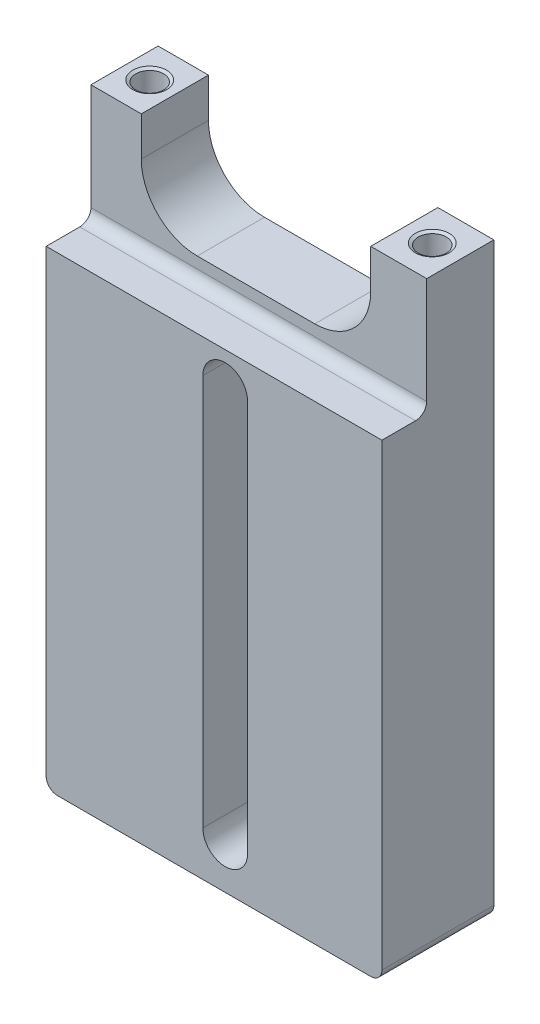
ISO-10303-21;
HEADER;
FILE_DESCRIPTION(('STEP AP214'),'2;1');
FILE_NAME('part.step','',(''),(''),'','','');
FILE_SCHEMA(('AUTOMOTIVE_DESIGN { 1 0 10303 214 1 1 1 1 }'));
ENDSEC;
DATA;
#1=APPLICATION_CONTEXT('core data for automotive mechanical design processes');
#2=APPLICATION_PROTOCOL_DEFINITION('international standard','automotive_design',2000,#1);
#3=PRODUCT_CONTEXT('',#1,'mechanical');
#4=PRODUCT('Part','Part','',(#3));
#5=PRODUCT_RELATED_PRODUCT_CATEGORY('part','',(#4));
#6=PRODUCT_DEFINITION_FORMATION('','',#4);
#7=PRODUCT_DEFINITION_CONTEXT('part definition',#1,'design');
#8=PRODUCT_DEFINITION('design','',#6,#7);
#9=PRODUCT_DEFINITION_SHAPE('','',#8);
#10=(LENGTH_UNIT() NAMED_UNIT(*) SI_UNIT(.MILLI.,.METRE.));
#11=(NAMED_UNIT(*) PLANE_ANGLE_UNIT() SI_UNIT($,.RADIAN.));
#12=(NAMED_UNIT(*) SI_UNIT($,.STERADIAN.) SOLID_ANGLE_UNIT());
#13=UNCERTAINTY_MEASURE_WITH_UNIT(LENGTH_MEASURE(1.E-05),#10,'distance_accuracy_value','');
#14=(GEOMETRIC_REPRESENTATION_CONTEXT(3) GLOBAL_UNCERTAINTY_ASSIGNED_CONTEXT((#13)) GLOBAL_UNIT_ASSIGNED_CONTEXT((#10,
#11,#12)) REPRESENTATION_CONTEXT('',''));
#15=CARTESIAN_POINT('',(0.,0.,0.));
#16=DIRECTION('',(0.,0.,1.));
#17=DIRECTION('',(1.,0.,0.));
#18=AXIS2_PLACEMENT_3D('',#15,#16,#17);
#19=CARTESIAN_POINT('',(20.,105.,20.));
#20=DIRECTION('',(0.,-1.,0.));
#21=DIRECTION('',(1.,0.,0.));
#22=AXIS2_PLACEMENT_3D('',#19,#20,#21);
#23=PLANE('',#22);
#24=CARTESIAN_POINT('',(24.9999999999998,105.,6.));
#25=DIRECTION('',(0.,1.,0.));
#26=DIRECTION('',(0.,0.,1.));
#27=AXIS2_PLACEMENT_3D('',#24,#25,#26);
#28=CIRCLE('',#27,3.025);
#29=CARTESIAN_POINT('',(24.9999999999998,105.,9.025));
#30=VERTEX_POINT('',#29);
#31=EDGE_CURVE('E180',#30,#30,#28,.T.);
#32=ORIENTED_EDGE('',*,*,#31,.F.);
#33=EDGE_LOOP('',(#32));
#34=FACE_BOUND('',#33,.T.);
#35=DIRECTION('',(0.,0.,-1.));
#36=VECTOR('',#35,1.);
#37=CARTESIAN_POINT('',(20.,105.,20.));
#38=LINE('',#37,#36);
#39=CARTESIAN_POINT('',(20.,105.,12.));
#40=VERTEX_POINT('',#39);
#41=CARTESIAN_POINT('',(20.,105.,0.));
#42=VERTEX_POINT('',#41);
#43=EDGE_CURVE('E311',#40,#42,#38,.T.);
#44=ORIENTED_EDGE('',*,*,#43,.F.);
#45=DIRECTION('',(1.,0.,0.));
#46=VECTOR('',#45,1.);
#47=CARTESIAN_POINT('',(20.,105.,12.));
#48=LINE('',#47,#46);
#49=CARTESIAN_POINT('',(30.,105.,12.));
#50=VERTEX_POINT('',#49);
#51=EDGE_CURVE('E259',#40,#50,#48,.T.);
#52=ORIENTED_EDGE('',*,*,#51,.T.);
#53=DIRECTION('',(0.,0.,-1.));
#54=VECTOR('',#53,1.);
#55=CARTESIAN_POINT('',(30.,105.,20.));
#56=LINE('',#55,#54);
#57=CARTESIAN_POINT('',(30.,105.,0.));
#58=VERTEX_POINT('',#57);
#59=EDGE_CURVE('E270',#50,#58,#56,.T.);
#60=ORIENTED_EDGE('',*,*,#59,.T.);
#61=DIRECTION('',(-1.,0.,0.));
#62=VECTOR('',#61,1.);
#63=CARTESIAN_POINT('',(20.,105.,0.));
#64=LINE('',#63,#62);
#65=EDGE_CURVE('E262',#58,#42,#64,.T.);
#66=ORIENTED_EDGE('',*,*,#65,.T.);
#67=EDGE_LOOP('',(#44,#52,#60,#66));
#68=FACE_BOUND('',#67,.T.);
#69=ADVANCED_FACE('F33',(#34,#68),#23,.F.);
#70=CARTESIAN_POINT('',(20.,98.,20.));
#71=DIRECTION('',(1.,0.,0.));
#72=DIRECTION('',(0.,0.,-1.));
#73=AXIS2_PLACEMENT_3D('',#70,#71,#72);
#74=PLANE('',#73);
#75=DIRECTION('',(0.,0.,-1.));
#76=VECTOR('',#75,1.);
#77=CARTESIAN_POINT('',(20.,98.,20.));
#78=LINE('',#77,#76);
#79=CARTESIAN_POINT('',(20.,98.,12.));
#80=VERTEX_POINT('',#79);
#81=CARTESIAN_POINT('',(20.,98.,0.));
#82=VERTEX_POINT('',#81);
#83=EDGE_CURVE('E309',#80,#82,#78,.T.);
#84=ORIENTED_EDGE('',*,*,#83,.F.);
#85=DIRECTION('',(0.,1.,0.));
#86=VECTOR('',#85,1.);
#87=CARTESIAN_POINT('',(20.,98.,12.));
#88=LINE('',#87,#86);
#89=EDGE_CURVE('E256',#80,#40,#88,.T.);
#90=ORIENTED_EDGE('',*,*,#89,.T.);
#91=ORIENTED_EDGE('',*,*,#43,.T.);
#92=DIRECTION('',(0.,-1.,0.));
#93=VECTOR('',#92,1.);
#94=CARTESIAN_POINT('',(20.,98.,0.));
#95=LINE('',#94,#93);
#96=EDGE_CURVE('E273',#42,#82,#95,.T.);
#97=ORIENTED_EDGE('',*,*,#96,.T.);
#98=EDGE_LOOP('',(#84,#90,#91,#97));
#99=FACE_BOUND('',#98,.T.);
#100=ADVANCED_FACE('F384',(#99),#74,.F.);
#101=CARTESIAN_POINT('',(10.,98.,20.));
#102=DIRECTION('',(0.,0.,-1.));
#103=DIRECTION('',(-1.,0.,0.));
#104=AXIS2_PLACEMENT_3D('',#101,#102,#103);
#105=CYLINDRICAL_SURFACE('',#104,10.);
#106=DIRECTION('',(0.,0.,-1.));
#107=VECTOR('',#106,1.);
#108=CARTESIAN_POINT('',(9.99999999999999,88.,20.));
#109=LINE('',#108,#107);
#110=CARTESIAN_POINT('',(9.99999999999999,88.,12.));
#111=VERTEX_POINT('',#110);
#112=CARTESIAN_POINT('',(9.99999999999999,88.,0.));
#113=VERTEX_POINT('',#112);
#114=EDGE_CURVE('E307',#111,#113,#109,.T.);
#115=ORIENTED_EDGE('',*,*,#114,.F.);
#116=CARTESIAN_POINT('',(10.,98.,12.));
#117=DIRECTION('',(0.,0.,-1.));
#118=DIRECTION('',(-1.,0.,0.));
#119=AXIS2_PLACEMENT_3D('',#116,#117,#118);
#120=CIRCLE('',#119,10.);
#121=EDGE_CURVE('E253',#111,#80,#120,.F.);
#122=ORIENTED_EDGE('',*,*,#121,.T.);
#123=ORIENTED_EDGE('',*,*,#83,.T.);
#124=CARTESIAN_POINT('',(10.,98.,0.));
#125=DIRECTION('',(0.,0.,-1.));
#126=DIRECTION('',(1.,0.,0.));
#127=AXIS2_PLACEMENT_3D('',#124,#125,#126);
#128=CIRCLE('',#127,10.);
#129=EDGE_CURVE('E276',#82,#113,#128,.T.);
#130=ORIENTED_EDGE('',*,*,#129,.T.);
#131=EDGE_LOOP('',(#115,#122,#123,#130));
#132=FACE_BOUND('',#131,.T.);
#133=ADVANCED_FACE('F387',(#132),#105,.F.);
#134=CARTESIAN_POINT('',(-11.,88.,20.));
#135=DIRECTION('',(0.,-1.,0.));
#136=DIRECTION('',(0.,0.,-1.));
#137=AXIS2_PLACEMENT_3D('',#134,#135,#136);
#138=PLANE('',#137);
#139=DIRECTION('',(0.,0.,-1.));
#140=VECTOR('',#139,1.);
#141=CARTESIAN_POINT('',(-11.,88.,20.));
#142=LINE('',#141,#140);
#143=CARTESIAN_POINT('',(-11.,88.,12.));
#144=VERTEX_POINT('',#143);
#145=CARTESIAN_POINT('',(-11.,88.,0.));
#146=VERTEX_POINT('',#145);
#147=EDGE_CURVE('E305',#144,#146,#142,.T.);
#148=ORIENTED_EDGE('',*,*,#147,.F.);
#149=DIRECTION('',(1.,0.,0.));
#150=VECTOR('',#149,1.);
#151=CARTESIAN_POINT('',(-11.,88.,12.));
#152=LINE('',#151,#150);
#153=EDGE_CURVE('E250',#144,#111,#152,.T.);
#154=ORIENTED_EDGE('',*,*,#153,.T.);
#155=ORIENTED_EDGE('',*,*,#114,.T.);
#156=DIRECTION('',(-1.,0.,0.));
#157=VECTOR('',#156,1.);
#158=CARTESIAN_POINT('',(-11.,88.,0.));
#159=LINE('',#158,#157);
#160=EDGE_CURVE('E279',#113,#146,#159,.T.);
#161=ORIENTED_EDGE('',*,*,#160,.T.);
#162=EDGE_LOOP('',(#148,#154,#155,#161));
#163=FACE_BOUND('',#162,.T.);
#164=ADVANCED_FACE('F391',(#163),#138,.F.);
#165=CARTESIAN_POINT('',(-11.,98.,20.));
#166=DIRECTION('',(0.,0.,-1.));
#167=DIRECTION('',(-1.,0.,0.));
#168=AXIS2_PLACEMENT_3D('',#165,#166,#167);
#169=CYLINDRICAL_SURFACE('',#168,10.);
#170=DIRECTION('',(0.,0.,-1.));
#171=VECTOR('',#170,1.);
#172=CARTESIAN_POINT('',(-21.,98.,20.));
#173=LINE('',#172,#171);
#174=CARTESIAN_POINT('',(-21.,98.,12.));
#175=VERTEX_POINT('',#174);
#176=CARTESIAN_POINT('',(-21.,98.,0.));
#177=VERTEX_POINT('',#176);
#178=EDGE_CURVE('E303',#175,#177,#173,.T.);
#179=ORIENTED_EDGE('',*,*,#178,.F.);
#180=CARTESIAN_POINT('',(-11.,98.,12.));
#181=DIRECTION('',(0.,0.,-1.));
#182=DIRECTION('',(-1.,0.,0.));
#183=AXIS2_PLACEMENT_3D('',#180,#181,#182);
#184=CIRCLE('',#183,10.);
#185=EDGE_CURVE('E247',#175,#144,#184,.F.);
#186=ORIENTED_EDGE('',*,*,#185,.T.);
#187=ORIENTED_EDGE('',*,*,#147,.T.);
#188=CARTESIAN_POINT('',(-11.,98.,0.));
#189=DIRECTION('',(0.,0.,-1.));
#190=DIRECTION('',(1.,0.,0.));
#191=AXIS2_PLACEMENT_3D('',#188,#189,#190);
#192=CIRCLE('',#191,10.);
#193=EDGE_CURVE('E282',#146,#177,#192,.T.);
#194=ORIENTED_EDGE('',*,*,#193,.T.);
#195=EDGE_LOOP('',(#179,#186,#187,#194));
#196=FACE_BOUND('',#195,.T.);
#197=ADVANCED_FACE('F393',(#196),#169,.F.);
#198=CARTESIAN_POINT('',(-21.,105.,20.));
#199=DIRECTION('',(-1.,0.,0.));
#200=DIRECTION('',(0.,0.,1.));
#201=AXIS2_PLACEMENT_3D('',#198,#199,#200);
#202=PLANE('',#201);
#203=DIRECTION('',(0.,0.,-1.));
#204=VECTOR('',#203,1.);
#205=CARTESIAN_POINT('',(-21.,105.,20.));
#206=LINE('',#205,#204);
#207=CARTESIAN_POINT('',(-21.,105.,12.));
#208=VERTEX_POINT('',#207);
#209=CARTESIAN_POINT('',(-21.,105.,0.));
#210=VERTEX_POINT('',#209);
#211=EDGE_CURVE('E301',#208,#210,#206,.T.);
#212=ORIENTED_EDGE('',*,*,#211,.F.);
#213=DIRECTION('',(0.,-1.,0.));
#214=VECTOR('',#213,1.);
#215=CARTESIAN_POINT('',(-21.,105.,12.));
#216=LINE('',#215,#214);
#217=EDGE_CURVE('E244',#208,#175,#216,.T.);
#218=ORIENTED_EDGE('',*,*,#217,.T.);
#219=ORIENTED_EDGE('',*,*,#178,.T.);
#220=DIRECTION('',(0.,1.,0.));
#221=VECTOR('',#220,1.);
#222=CARTESIAN_POINT('',(-21.,105.,0.));
#223=LINE('',#222,#221);
#224=EDGE_CURVE('E285',#177,#210,#223,.T.);
#225=ORIENTED_EDGE('',*,*,#224,.T.);
#226=EDGE_LOOP('',(#212,#218,#219,#225));
#227=FACE_BOUND('',#226,.T.);
#228=ADVANCED_FACE('F356',(#227),#202,.F.);
#229=CARTESIAN_POINT('',(-30.,105.,20.));
#230=DIRECTION('',(0.,-1.,0.));
#231=DIRECTION('',(1.,0.,0.));
#232=AXIS2_PLACEMENT_3D('',#229,#230,#231);
#233=PLANE('',#232);
#234=CARTESIAN_POINT('',(-25.5000000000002,105.,6.00000000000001));
#235=DIRECTION('',(0.,1.,0.));
#236=DIRECTION('',(0.,0.,1.));
#237=AXIS2_PLACEMENT_3D('',#234,#235,#236);
#238=CIRCLE('',#237,3.025);
#239=CARTESIAN_POINT('',(-25.5000000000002,105.,9.02500000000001));
#240=VERTEX_POINT('',#239);
#241=EDGE_CURVE('E187',#240,#240,#238,.T.);
#242=ORIENTED_EDGE('',*,*,#241,.F.);
#243=EDGE_LOOP('',(#242));
#244=FACE_BOUND('',#243,.T.);
#245=DIRECTION('',(0.,0.,-1.));
#246=VECTOR('',#245,1.);
#247=CARTESIAN_POINT('',(-30.,105.,20.));
#248=LINE('',#247,#246);
#249=CARTESIAN_POINT('',(-30.,105.,12.));
#250=VERTEX_POINT('',#249);
#251=CARTESIAN_POINT('',(-30.,105.,0.));
#252=VERTEX_POINT('',#251);
#253=EDGE_CURVE('E299',#250,#252,#248,.T.);
#254=ORIENTED_EDGE('',*,*,#253,.F.);
#255=DIRECTION('',(1.,0.,0.));
#256=VECTOR('',#255,1.);
#257=CARTESIAN_POINT('',(-30.,105.,12.));
#258=LINE('',#257,#256);
#259=EDGE_CURVE('E240',#250,#208,#258,.T.);
#260=ORIENTED_EDGE('',*,*,#259,.T.);
#261=ORIENTED_EDGE('',*,*,#211,.T.);
#262=DIRECTION('',(-1.,0.,0.));
#263=VECTOR('',#262,1.);
#264=CARTESIAN_POINT('',(-30.,105.,0.));
#265=LINE('',#264,#263);
#266=EDGE_CURVE('E288',#210,#252,#265,.T.);
#267=ORIENTED_EDGE('',*,*,#266,.T.);
#268=EDGE_LOOP('',(#254,#260,#261,#267));
#269=FACE_BOUND('',#268,.T.);
#270=ADVANCED_FACE('F354',(#244,#269),#233,.F.);
#271=CARTESIAN_POINT('',(-30.,0.,20.));
#272=DIRECTION('',(1.,0.,0.));
#273=DIRECTION('',(0.,1.,0.));
#274=AXIS2_PLACEMENT_3D('',#271,#272,#273);
#275=PLANE('',#274);
#276=DIRECTION('',(0.,-1.,0.));
#277=VECTOR('',#276,1.);
#278=CARTESIAN_POINT('',(-30.,0.,0.));
#279=LINE('',#278,#277);
#280=CARTESIAN_POINT('',(-30.,2.,0.));
#281=VERTEX_POINT('',#280);
#282=EDGE_CURVE('E291',#252,#281,#279,.T.);
#283=ORIENTED_EDGE('',*,*,#282,.T.);
#284=DIRECTION('',(0.,0.,-1.));
#285=VECTOR('',#284,1.);
#286=CARTESIAN_POINT('',(-30.,2.,20.));
#287=LINE('',#286,#285);
#288=CARTESIAN_POINT('',(-30.,2.,20.));
#289=VERTEX_POINT('',#288);
#290=EDGE_CURVE('E56',#281,#289,#287,.F.);
#291=ORIENTED_EDGE('',*,*,#290,.T.);
#292=DIRECTION('',(0.,-1.,0.));
#293=VECTOR('',#292,1.);
#294=CARTESIAN_POINT('',(-30.,0.,20.));
#295=LINE('',#294,#293);
#296=CARTESIAN_POINT('',(-30.,84.,20.));
#297=VERTEX_POINT('',#296);
#298=EDGE_CURVE('E263',#297,#289,#295,.T.);
#299=ORIENTED_EDGE('',*,*,#298,.F.);
#300=DIRECTION('',(0.,0.,1.));
#301=VECTOR('',#300,1.);
#302=CARTESIAN_POINT('',(-30.,84.,12.));
#303=LINE('',#302,#301);
#304=CARTESIAN_POINT('',(-30.,84.,14.));
#305=VERTEX_POINT('',#304);
#306=EDGE_CURVE('E234',#305,#297,#303,.T.);
#307=ORIENTED_EDGE('',*,*,#306,.F.);
#308=CARTESIAN_POINT('',(-30.,86.,14.));
#309=DIRECTION('',(1.,0.,0.));
#310=DIRECTION('',(0.,1.,0.));
#311=AXIS2_PLACEMENT_3D('',#308,#309,#310);
#312=CIRCLE('',#311,2.);
#313=CARTESIAN_POINT('',(-30.,86.,12.));
#314=VERTEX_POINT('',#313);
#315=EDGE_CURVE('E11',#305,#314,#312,.T.);
#316=ORIENTED_EDGE('',*,*,#315,.T.);
#317=DIRECTION('',(0.,-1.,0.));
#318=VECTOR('',#317,1.);
#319=CARTESIAN_POINT('',(-30.,139.670454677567,12.));
#320=LINE('',#319,#318);
#321=EDGE_CURVE('E229',#250,#314,#320,.T.);
#322=ORIENTED_EDGE('',*,*,#321,.F.);
#323=ORIENTED_EDGE('',*,*,#253,.T.);
#324=EDGE_LOOP('',(#283,#291,#299,#307,#316,#322,#323));
#325=FACE_BOUND('',#324,.T.);
#326=ADVANCED_FACE('F348',(#325),#275,.F.);
#327=CARTESIAN_POINT('',(30.,0.,20.));
#328=DIRECTION('',(0.,1.,0.));
#329=DIRECTION('',(0.,0.,1.));
#330=AXIS2_PLACEMENT_3D('',#327,#328,#329);
#331=PLANE('',#330);
#332=DIRECTION('',(1.,0.,0.));
#333=VECTOR('',#332,1.);
#334=CARTESIAN_POINT('',(30.,0.,20.));
#335=LINE('',#334,#333);
#336=CARTESIAN_POINT('',(-28.,0.,20.));
#337=VERTEX_POINT('',#336);
#338=CARTESIAN_POINT('',(28.,0.,20.));
#339=VERTEX_POINT('',#338);
#340=EDGE_CURVE('E265',#337,#339,#335,.T.);
#341=ORIENTED_EDGE('',*,*,#340,.F.);
#342=DIRECTION('',(0.,0.,-1.));
#343=VECTOR('',#342,1.);
#344=CARTESIAN_POINT('',(-28.,0.,20.));
#345=LINE('',#344,#343);
#346=CARTESIAN_POINT('',(-28.,0.,0.));
#347=VERTEX_POINT('',#346);
#348=EDGE_CURVE('E320',#337,#347,#345,.T.);
#349=ORIENTED_EDGE('',*,*,#348,.T.);
#350=DIRECTION('',(1.,0.,0.));
#351=VECTOR('',#350,1.);
#352=CARTESIAN_POINT('',(30.,0.,0.));
#353=LINE('',#352,#351);
#354=CARTESIAN_POINT('',(28.,0.,0.));
#355=VERTEX_POINT('',#354);
#356=EDGE_CURVE('E293',#347,#355,#353,.T.);
#357=ORIENTED_EDGE('',*,*,#356,.T.);
#358=DIRECTION('',(0.,0.,-1.));
#359=VECTOR('',#358,1.);
#360=CARTESIAN_POINT('',(28.,0.,20.));
#361=LINE('',#360,#359);
#362=EDGE_CURVE('E318',#355,#339,#361,.F.);
#363=ORIENTED_EDGE('',*,*,#362,.T.);
#364=EDGE_LOOP('',(#341,#349,#357,#363));
#365=FACE_BOUND('',#364,.T.);
#366=ADVANCED_FACE('F372',(#365),#331,.F.);
#367=CARTESIAN_POINT('',(30.,105.,20.));
#368=DIRECTION('',(-1.,0.,0.));
#369=DIRECTION('',(0.,-1.,0.));
#370=AXIS2_PLACEMENT_3D('',#367,#368,#369);
#371=PLANE('',#370);
#372=DIRECTION('',(0.,1.,0.));
#373=VECTOR('',#372,1.);
#374=CARTESIAN_POINT('',(30.,105.,20.));
#375=LINE('',#374,#373);
#376=CARTESIAN_POINT('',(30.,2.,20.));
#377=VERTEX_POINT('',#376);
#378=CARTESIAN_POINT('',(30.,84.,20.));
#379=VERTEX_POINT('',#378);
#380=EDGE_CURVE('E268',#377,#379,#375,.T.);
#381=ORIENTED_EDGE('',*,*,#380,.F.);
#382=DIRECTION('',(0.,0.,-1.));
#383=VECTOR('',#382,1.);
#384=CARTESIAN_POINT('',(30.,2.,20.));
#385=LINE('',#384,#383);
#386=CARTESIAN_POINT('',(30.,2.,0.));
#387=VERTEX_POINT('',#386);
#388=EDGE_CURVE('E331',#377,#387,#385,.T.);
#389=ORIENTED_EDGE('',*,*,#388,.T.);
#390=DIRECTION('',(0.,1.,0.));
#391=VECTOR('',#390,1.);
#392=CARTESIAN_POINT('',(30.,105.,0.));
#393=LINE('',#392,#391);
#394=EDGE_CURVE('E266',#387,#58,#393,.T.);
#395=ORIENTED_EDGE('',*,*,#394,.T.);
#396=ORIENTED_EDGE('',*,*,#59,.F.);
#397=DIRECTION('',(0.,1.,0.));
#398=VECTOR('',#397,1.);
#399=CARTESIAN_POINT('',(30.,139.670454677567,12.));
#400=LINE('',#399,#398);
#401=CARTESIAN_POINT('',(30.,86.,12.));
#402=VERTEX_POINT('',#401);
#403=EDGE_CURVE('E232',#402,#50,#400,.T.);
#404=ORIENTED_EDGE('',*,*,#403,.F.);
#405=CARTESIAN_POINT('',(30.,86.,14.));
#406=DIRECTION('',(-1.,0.,0.));
#407=DIRECTION('',(0.,-1.,0.));
#408=AXIS2_PLACEMENT_3D('',#405,#406,#407);
#409=CIRCLE('',#408,2.);
#410=CARTESIAN_POINT('',(30.,84.,14.));
#411=VERTEX_POINT('',#410);
#412=EDGE_CURVE('E41',#402,#411,#409,.T.);
#413=ORIENTED_EDGE('',*,*,#412,.T.);
#414=DIRECTION('',(0.,0.,1.));
#415=VECTOR('',#414,1.);
#416=CARTESIAN_POINT('',(30.,84.,12.));
#417=LINE('',#416,#415);
#418=EDGE_CURVE('E237',#411,#379,#417,.T.);
#419=ORIENTED_EDGE('',*,*,#418,.T.);
#420=EDGE_LOOP('',(#381,#389,#395,#396,#404,#413,#419));
#421=FACE_BOUND('',#420,.T.);
#422=ADVANCED_FACE('F336',(#421),#371,.F.);
#423=CARTESIAN_POINT('',(-11.,98.,20.));
#424=DIRECTION('',(0.,0.,1.));
#425=DIRECTION('',(1.,0.,0.));
#426=AXIS2_PLACEMENT_3D('',#423,#424,#425);
#427=PLANE('',#426);
#428=CARTESIAN_POINT('',(2.00000000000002,78.,20.));
#429=DIRECTION('',(0.,0.,1.));
#430=DIRECTION('',(1.,0.,0.));
#431=AXIS2_PLACEMENT_3D('',#428,#429,#430);
#432=CIRCLE('',#431,4.);
#433=CARTESIAN_POINT('',(-1.99999999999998,78.,20.));
#434=VERTEX_POINT('',#433);
#435=CARTESIAN_POINT('',(6.00000000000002,78.,20.));
#436=VERTEX_POINT('',#435);
#437=EDGE_CURVE('E202',#434,#436,#432,.F.);
#438=ORIENTED_EDGE('',*,*,#437,.T.);
#439=DIRECTION('',(0.,-1.,0.));
#440=VECTOR('',#439,1.);
#441=CARTESIAN_POINT('',(6.00000000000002,78.,20.));
#442=LINE('',#441,#440);
#443=CARTESIAN_POINT('',(6.00000000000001,7.99999999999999,20.));
#444=VERTEX_POINT('',#443);
#445=EDGE_CURVE('E219',#436,#444,#442,.T.);
#446=ORIENTED_EDGE('',*,*,#445,.T.);
#447=CARTESIAN_POINT('',(2.,8.,20.));
#448=DIRECTION('',(0.,0.,1.));
#449=DIRECTION('',(1.,0.,0.));
#450=AXIS2_PLACEMENT_3D('',#447,#448,#449);
#451=CIRCLE('',#450,4.);
#452=CARTESIAN_POINT('',(-2.,8.,20.));
#453=VERTEX_POINT('',#452);
#454=EDGE_CURVE('E196',#444,#453,#451,.F.);
#455=ORIENTED_EDGE('',*,*,#454,.T.);
#456=DIRECTION('',(0.,1.,0.));
#457=VECTOR('',#456,1.);
#458=CARTESIAN_POINT('',(-1.99999999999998,78.,20.));
#459=LINE('',#458,#457);
#460=EDGE_CURVE('E199',#453,#434,#459,.T.);
#461=ORIENTED_EDGE('',*,*,#460,.T.);
#462=EDGE_LOOP('',(#438,#446,#455,#461));
#463=FACE_BOUND('',#462,.T.);
#464=ORIENTED_EDGE('',*,*,#298,.T.);
#465=CARTESIAN_POINT('',(-28.,2.,20.));
#466=DIRECTION('',(0.,0.,1.));
#467=DIRECTION('',(1.,0.,0.));
#468=AXIS2_PLACEMENT_3D('',#465,#466,#467);
#469=CIRCLE('',#468,2.);
#470=EDGE_CURVE('E329',#289,#337,#469,.T.);
#471=ORIENTED_EDGE('',*,*,#470,.T.);
#472=ORIENTED_EDGE('',*,*,#340,.T.);
#473=CARTESIAN_POINT('',(28.,2.,20.));
#474=DIRECTION('',(0.,0.,1.));
#475=DIRECTION('',(1.,0.,0.));
#476=AXIS2_PLACEMENT_3D('',#473,#474,#475);
#477=CIRCLE('',#476,2.);
#478=EDGE_CURVE('E48',#339,#377,#477,.T.);
#479=ORIENTED_EDGE('',*,*,#478,.T.);
#480=ORIENTED_EDGE('',*,*,#380,.T.);
#481=DIRECTION('',(1.,0.,0.));
#482=VECTOR('',#481,1.);
#483=CARTESIAN_POINT('',(-30.,84.,20.));
#484=LINE('',#483,#482);
#485=EDGE_CURVE('E228',#297,#379,#484,.T.);
#486=ORIENTED_EDGE('',*,*,#485,.F.);
#487=EDGE_LOOP('',(#464,#471,#472,#479,#480,#486));
#488=FACE_BOUND('',#487,.T.);
#489=ADVANCED_FACE('F370',(#463,#488),#427,.T.);
#490=CARTESIAN_POINT('',(-11.,98.,0.));
#491=DIRECTION('',(0.,0.,1.));
#492=DIRECTION('',(1.,0.,0.));
#493=AXIS2_PLACEMENT_3D('',#490,#491,#492);
#494=PLANE('',#493);
#495=DIRECTION('',(0.,-1.,0.));
#496=VECTOR('',#495,1.);
#497=CARTESIAN_POINT('',(6.00000000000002,78.,0.));
#498=LINE('',#497,#496);
#499=CARTESIAN_POINT('',(6.00000000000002,78.,0.));
#500=VERTEX_POINT('',#499);
#501=CARTESIAN_POINT('',(6.00000000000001,8.,0.));
#502=VERTEX_POINT('',#501);
#503=EDGE_CURVE('E207',#500,#502,#498,.T.);
#504=ORIENTED_EDGE('',*,*,#503,.F.);
#505=CARTESIAN_POINT('',(2.00000000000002,78.,0.));
#506=DIRECTION('',(0.,0.,-1.));
#507=DIRECTION('',(1.,0.,0.));
#508=AXIS2_PLACEMENT_3D('',#505,#506,#507);
#509=CIRCLE('',#508,4.);
#510=CARTESIAN_POINT('',(-1.99999999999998,78.,0.));
#511=VERTEX_POINT('',#510);
#512=EDGE_CURVE('E205',#511,#500,#509,.T.);
#513=ORIENTED_EDGE('',*,*,#512,.F.);
#514=DIRECTION('',(0.,1.,0.));
#515=VECTOR('',#514,1.);
#516=CARTESIAN_POINT('',(-1.99999999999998,78.,0.));
#517=LINE('',#516,#515);
#518=CARTESIAN_POINT('',(-2.,8.,0.));
#519=VERTEX_POINT('',#518);
#520=EDGE_CURVE('E213',#519,#511,#517,.T.);
#521=ORIENTED_EDGE('',*,*,#520,.F.);
#522=CARTESIAN_POINT('',(2.,8.,0.));
#523=DIRECTION('',(0.,0.,-1.));
#524=DIRECTION('',(-1.,0.,0.));
#525=AXIS2_PLACEMENT_3D('',#522,#523,#524);
#526=CIRCLE('',#525,4.);
#527=EDGE_CURVE('E210',#502,#519,#526,.T.);
#528=ORIENTED_EDGE('',*,*,#527,.F.);
#529=EDGE_LOOP('',(#504,#513,#521,#528));
#530=FACE_BOUND('',#529,.T.);
#531=ORIENTED_EDGE('',*,*,#356,.F.);
#532=CARTESIAN_POINT('',(-28.,2.,0.));
#533=DIRECTION('',(0.,0.,1.));
#534=DIRECTION('',(1.,0.,0.));
#535=AXIS2_PLACEMENT_3D('',#532,#533,#534);
#536=CIRCLE('',#535,2.);
#537=EDGE_CURVE('E325',#347,#281,#536,.F.);
#538=ORIENTED_EDGE('',*,*,#537,.T.);
#539=ORIENTED_EDGE('',*,*,#282,.F.);
#540=ORIENTED_EDGE('',*,*,#266,.F.);
#541=ORIENTED_EDGE('',*,*,#224,.F.);
#542=ORIENTED_EDGE('',*,*,#193,.F.);
#543=ORIENTED_EDGE('',*,*,#160,.F.);
#544=ORIENTED_EDGE('',*,*,#129,.F.);
#545=ORIENTED_EDGE('',*,*,#96,.F.);
#546=ORIENTED_EDGE('',*,*,#65,.F.);
#547=ORIENTED_EDGE('',*,*,#394,.F.);
#548=CARTESIAN_POINT('',(28.,2.,0.));
#549=DIRECTION('',(0.,0.,1.));
#550=DIRECTION('',(1.,0.,0.));
#551=AXIS2_PLACEMENT_3D('',#548,#549,#550);
#552=CIRCLE('',#551,2.);
#553=EDGE_CURVE('E323',#387,#355,#552,.F.);
#554=ORIENTED_EDGE('',*,*,#553,.T.);
#555=EDGE_LOOP('',(#531,#538,#539,#540,#541,#542,#543,#544,#545,#546,#547,#554));
#556=FACE_BOUND('',#555,.T.);
#557=ADVANCED_FACE('F364',(#530,#556),#494,.F.);
#558=CARTESIAN_POINT('',(30.,139.670454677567,12.));
#559=DIRECTION('',(0.,0.,-1.));
#560=DIRECTION('',(-1.,0.,0.));
#561=AXIS2_PLACEMENT_3D('',#558,#559,#560);
#562=PLANE('',#561);
#563=ORIENTED_EDGE('',*,*,#321,.T.);
#564=DIRECTION('',(1.,0.,0.));
#565=VECTOR('',#564,1.);
#566=CARTESIAN_POINT('',(30.,86.,12.));
#567=LINE('',#566,#565);
#568=EDGE_CURVE('E313',#314,#402,#567,.T.);
#569=ORIENTED_EDGE('',*,*,#568,.T.);
#570=ORIENTED_EDGE('',*,*,#403,.T.);
#571=ORIENTED_EDGE('',*,*,#51,.F.);
#572=ORIENTED_EDGE('',*,*,#89,.F.);
#573=ORIENTED_EDGE('',*,*,#121,.F.);
#574=ORIENTED_EDGE('',*,*,#153,.F.);
#575=ORIENTED_EDGE('',*,*,#185,.F.);
#576=ORIENTED_EDGE('',*,*,#217,.F.);
#577=ORIENTED_EDGE('',*,*,#259,.F.);
#578=EDGE_LOOP('',(#563,#569,#570,#571,#572,#573,#574,#575,#576,#577));
#579=FACE_BOUND('',#578,.T.);
#580=ADVANCED_FACE('F351',(#579),#562,.F.);
#581=CARTESIAN_POINT('',(-30.,84.,12.));
#582=DIRECTION('',(0.,-1.,0.));
#583=DIRECTION('',(0.,0.,-1.));
#584=AXIS2_PLACEMENT_3D('',#581,#582,#583);
#585=PLANE('',#584);
#586=ORIENTED_EDGE('',*,*,#418,.F.);
#587=DIRECTION('',(1.,0.,0.));
#588=VECTOR('',#587,1.);
#589=CARTESIAN_POINT('',(-30.,84.,14.));
#590=LINE('',#589,#588);
#591=EDGE_CURVE('E316',#411,#305,#590,.F.);
#592=ORIENTED_EDGE('',*,*,#591,.T.);
#593=ORIENTED_EDGE('',*,*,#306,.T.);
#594=ORIENTED_EDGE('',*,*,#485,.T.);
#595=EDGE_LOOP('',(#586,#592,#593,#594));
#596=FACE_BOUND('',#595,.T.);
#597=ADVANCED_FACE('F342',(#596),#585,.F.);
#598=CARTESIAN_POINT('',(2.00000000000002,78.,20.001));
#599=DIRECTION('',(0.,0.,-1.));
#600=DIRECTION('',(-1.,0.,0.));
#601=AXIS2_PLACEMENT_3D('',#598,#599,#600);
#602=CYLINDRICAL_SURFACE('',#601,4.);
#603=DIRECTION('',(0.,0.,-1.));
#604=VECTOR('',#603,1.);
#605=CARTESIAN_POINT('',(-1.99999999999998,78.,20.001));
#606=LINE('',#605,#604);
#607=EDGE_CURVE('E217',#434,#511,#606,.T.);
#608=ORIENTED_EDGE('',*,*,#607,.T.);
#609=ORIENTED_EDGE('',*,*,#512,.T.);
#610=DIRECTION('',(0.,0.,-1.));
#611=VECTOR('',#610,1.);
#612=CARTESIAN_POINT('',(6.00000000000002,78.,20.001));
#613=LINE('',#612,#611);
#614=EDGE_CURVE('E216',#436,#500,#613,.T.);
#615=ORIENTED_EDGE('',*,*,#614,.F.);
#616=ORIENTED_EDGE('',*,*,#437,.F.);
#617=EDGE_LOOP('',(#608,#609,#615,#616));
#618=FACE_BOUND('',#617,.T.);
#619=ADVANCED_FACE('F437',(#618),#602,.F.);
#620=CARTESIAN_POINT('',(-1.99999999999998,78.,20.001));
#621=DIRECTION('',(-1.,0.,0.));
#622=DIRECTION('',(0.,-1.,0.));
#623=AXIS2_PLACEMENT_3D('',#620,#621,#622);
#624=PLANE('',#623);
#625=DIRECTION('',(0.,0.,-1.));
#626=VECTOR('',#625,1.);
#627=CARTESIAN_POINT('',(-2.,8.,20.001));
#628=LINE('',#627,#626);
#629=EDGE_CURVE('E220',#453,#519,#628,.T.);
#630=ORIENTED_EDGE('',*,*,#629,.T.);
#631=ORIENTED_EDGE('',*,*,#520,.T.);
#632=ORIENTED_EDGE('',*,*,#607,.F.);
#633=ORIENTED_EDGE('',*,*,#460,.F.);
#634=EDGE_LOOP('',(#630,#631,#632,#633));
#635=FACE_BOUND('',#634,.T.);
#636=ADVANCED_FACE('F433',(#635),#624,.F.);
#637=CARTESIAN_POINT('',(2.,8.,20.001));
#638=DIRECTION('',(0.,0.,-1.));
#639=DIRECTION('',(-1.,0.,0.));
#640=AXIS2_PLACEMENT_3D('',#637,#638,#639);
#641=CYLINDRICAL_SURFACE('',#640,4.);
#642=DIRECTION('',(0.,0.,-1.));
#643=VECTOR('',#642,1.);
#644=CARTESIAN_POINT('',(6.00000000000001,8.,20.001));
#645=LINE('',#644,#643);
#646=EDGE_CURVE('E222',#444,#502,#645,.T.);
#647=ORIENTED_EDGE('',*,*,#646,.T.);
#648=ORIENTED_EDGE('',*,*,#527,.T.);
#649=ORIENTED_EDGE('',*,*,#629,.F.);
#650=ORIENTED_EDGE('',*,*,#454,.F.);
#651=EDGE_LOOP('',(#647,#648,#649,#650));
#652=FACE_BOUND('',#651,.T.);
#653=ADVANCED_FACE('F436',(#652),#641,.F.);
#654=CARTESIAN_POINT('',(6.00000000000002,78.,20.001));
#655=DIRECTION('',(1.,0.,0.));
#656=DIRECTION('',(0.,1.,0.));
#657=AXIS2_PLACEMENT_3D('',#654,#655,#656);
#658=PLANE('',#657);
#659=ORIENTED_EDGE('',*,*,#614,.T.);
#660=ORIENTED_EDGE('',*,*,#503,.T.);
#661=ORIENTED_EDGE('',*,*,#646,.F.);
#662=ORIENTED_EDGE('',*,*,#445,.F.);
#663=EDGE_LOOP('',(#659,#660,#661,#662));
#664=FACE_BOUND('',#663,.T.);
#665=ADVANCED_FACE('F413',(#664),#658,.F.);
#666=CARTESIAN_POINT('',(30.,86.,14.));
#667=DIRECTION('',(-1.,0.,0.));
#668=DIRECTION('',(0.,0.,1.));
#669=AXIS2_PLACEMENT_3D('',#666,#667,#668);
#670=CYLINDRICAL_SURFACE('',#669,2.);
#671=ORIENTED_EDGE('',*,*,#315,.F.);
#672=ORIENTED_EDGE('',*,*,#591,.F.);
#673=ORIENTED_EDGE('',*,*,#412,.F.);
#674=ORIENTED_EDGE('',*,*,#568,.F.);
#675=EDGE_LOOP('',(#671,#672,#673,#674));
#676=FACE_BOUND('',#675,.T.);
#677=ADVANCED_FACE('F346',(#676),#670,.F.);
#678=CARTESIAN_POINT('',(-28.,2.,20.));
#679=DIRECTION('',(0.,0.,-1.));
#680=DIRECTION('',(-1.,0.,0.));
#681=AXIS2_PLACEMENT_3D('',#678,#679,#680);
#682=CYLINDRICAL_SURFACE('',#681,2.);
#683=ORIENTED_EDGE('',*,*,#470,.F.);
#684=ORIENTED_EDGE('',*,*,#290,.F.);
#685=ORIENTED_EDGE('',*,*,#537,.F.);
#686=ORIENTED_EDGE('',*,*,#348,.F.);
#687=EDGE_LOOP('',(#683,#684,#685,#686));
#688=FACE_BOUND('',#687,.T.);
#689=ADVANCED_FACE('F367',(#688),#682,.T.);
#690=CARTESIAN_POINT('',(28.,2.,20.));
#691=DIRECTION('',(0.,0.,-1.));
#692=DIRECTION('',(-1.,0.,0.));
#693=AXIS2_PLACEMENT_3D('',#690,#691,#692);
#694=CYLINDRICAL_SURFACE('',#693,2.);
#695=ORIENTED_EDGE('',*,*,#478,.F.);
#696=ORIENTED_EDGE('',*,*,#362,.F.);
#697=ORIENTED_EDGE('',*,*,#553,.F.);
#698=ORIENTED_EDGE('',*,*,#388,.F.);
#699=EDGE_LOOP('',(#695,#696,#697,#698));
#700=FACE_BOUND('',#699,.T.);
#701=ADVANCED_FACE('F35',(#700),#694,.T.);
#702=CARTESIAN_POINT('',(24.9999999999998,78.,6.));
#703=DIRECTION('',(0.,1.,0.));
#704=DIRECTION('',(0.,0.,1.));
#705=AXIS2_PLACEMENT_3D('',#702,#703,#704);
#706=CONICAL_SURFACE('',#705,2.5,1.02974425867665);
#707=CARTESIAN_POINT('',(24.9999999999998,76.4978484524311,6.));
#708=VERTEX_POINT('',#707);
#709=VERTEX_LOOP('',#708);
#710=FACE_BOUND('',#709,.T.);
#711=CARTESIAN_POINT('',(24.9999999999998,78.,6.));
#712=DIRECTION('',(0.,1.,0.));
#713=DIRECTION('',(0.,0.,1.));
#714=AXIS2_PLACEMENT_3D('',#711,#712,#713);
#715=CIRCLE('',#714,2.5);
#716=CARTESIAN_POINT('',(24.9999999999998,78.,8.5));
#717=VERTEX_POINT('',#716);
#718=EDGE_CURVE('E193',#717,#717,#715,.T.);
#719=ORIENTED_EDGE('',*,*,#718,.T.);
#720=EDGE_LOOP('',(#719));
#721=FACE_BOUND('',#720,.T.);
#722=ADVANCED_FACE('F418',(#710,#721),#706,.F.);
#723=CARTESIAN_POINT('',(24.9999999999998,105.,6.));
#724=DIRECTION('',(0.,1.,0.));
#725=DIRECTION('',(0.,0.,1.));
#726=AXIS2_PLACEMENT_3D('',#723,#724,#725);
#727=CYLINDRICAL_SURFACE('',#726,2.5);
#728=ORIENTED_EDGE('',*,*,#718,.F.);
#729=EDGE_LOOP('',(#728));
#730=FACE_BOUND('',#729,.T.);
#731=CARTESIAN_POINT('',(24.9999999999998,104.696891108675,6.));
#732=DIRECTION('',(0.,1.,0.));
#733=DIRECTION('',(0.,0.,1.));
#734=AXIS2_PLACEMENT_3D('',#731,#732,#733);
#735=CIRCLE('',#734,2.5);
#736=CARTESIAN_POINT('',(24.9999999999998,104.696891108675,8.5));
#737=VERTEX_POINT('',#736);
#738=EDGE_CURVE('E184',#737,#737,#735,.T.);
#739=ORIENTED_EDGE('',*,*,#738,.T.);
#740=EDGE_LOOP('',(#739));
#741=FACE_BOUND('',#740,.T.);
#742=ADVANCED_FACE('F422',(#730,#741),#727,.F.);
#743=CARTESIAN_POINT('',(24.9999999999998,105.,6.));
#744=DIRECTION('',(0.,1.,0.));
#745=DIRECTION('',(0.,0.,1.));
#746=AXIS2_PLACEMENT_3D('',#743,#744,#745);
#747=CONICAL_SURFACE('',#746,3.025,1.0471975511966);
#748=ORIENTED_EDGE('',*,*,#738,.F.);
#749=EDGE_LOOP('',(#748));
#750=FACE_BOUND('',#749,.T.);
#751=ORIENTED_EDGE('',*,*,#31,.T.);
#752=EDGE_LOOP('',(#751));
#753=FACE_BOUND('',#752,.T.);
#754=ADVANCED_FACE('F174',(#750,#753),#747,.F.);
#755=CARTESIAN_POINT('',(-25.5000000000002,78.,6.00000000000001));
#756=DIRECTION('',(0.,1.,0.));
#757=DIRECTION('',(0.,0.,1.));
#758=AXIS2_PLACEMENT_3D('',#755,#756,#757);
#759=CONICAL_SURFACE('',#758,2.5,1.02974425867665);
#760=CARTESIAN_POINT('',(-25.5000000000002,76.4978484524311,6.00000000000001));
#761=VERTEX_POINT('',#760);
#762=VERTEX_LOOP('',#761);
#763=FACE_BOUND('',#762,.T.);
#764=CARTESIAN_POINT('',(-25.5000000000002,78.,6.00000000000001));
#765=DIRECTION('',(0.,1.,0.));
#766=DIRECTION('',(0.,0.,1.));
#767=AXIS2_PLACEMENT_3D('',#764,#765,#766);
#768=CIRCLE('',#767,2.5);
#769=CARTESIAN_POINT('',(-25.5000000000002,78.,8.5));
#770=VERTEX_POINT('',#769);
#771=EDGE_CURVE('E178',#770,#770,#768,.T.);
#772=ORIENTED_EDGE('',*,*,#771,.T.);
#773=EDGE_LOOP('',(#772));
#774=FACE_BOUND('',#773,.T.);
#775=ADVANCED_FACE('F170',(#763,#774),#759,.F.);
#776=CARTESIAN_POINT('',(-25.5000000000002,105.,6.00000000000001));
#777=DIRECTION('',(0.,1.,0.));
#778=DIRECTION('',(0.,0.,1.));
#779=AXIS2_PLACEMENT_3D('',#776,#777,#778);
#780=CYLINDRICAL_SURFACE('',#779,2.5);
#781=ORIENTED_EDGE('',*,*,#771,.F.);
#782=EDGE_LOOP('',(#781));
#783=FACE_BOUND('',#782,.T.);
#784=CARTESIAN_POINT('',(-25.5000000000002,104.696891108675,6.00000000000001));
#785=DIRECTION('',(0.,1.,0.));
#786=DIRECTION('',(0.,0.,1.));
#787=AXIS2_PLACEMENT_3D('',#784,#785,#786);
#788=CIRCLE('',#787,2.5);
#789=CARTESIAN_POINT('',(-25.5000000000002,104.696891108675,8.50000000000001));
#790=VERTEX_POINT('',#789);
#791=EDGE_CURVE('E181',#790,#790,#788,.T.);
#792=ORIENTED_EDGE('',*,*,#791,.T.);
#793=EDGE_LOOP('',(#792));
#794=FACE_BOUND('',#793,.T.);
#795=ADVANCED_FACE('F173',(#783,#794),#780,.F.);
#796=CARTESIAN_POINT('',(-25.5000000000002,105.,6.00000000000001));
#797=DIRECTION('',(0.,1.,0.));
#798=DIRECTION('',(0.,0.,1.));
#799=AXIS2_PLACEMENT_3D('',#796,#797,#798);
#800=CONICAL_SURFACE('',#799,3.025,1.0471975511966);
#801=ORIENTED_EDGE('',*,*,#791,.F.);
#802=EDGE_LOOP('',(#801));
#803=FACE_BOUND('',#802,.T.);
#804=ORIENTED_EDGE('',*,*,#241,.T.);
#805=EDGE_LOOP('',(#804));
#806=FACE_BOUND('',#805,.T.);
#807=ADVANCED_FACE('F471',(#803,#806),#800,.F.);
#808=CLOSED_SHELL('',(#69,#100,#133,#164,#197,#228,#270,#326,#366,#422,#489,#557,#580,#597,#619,
#636,#653,#665,#677,#689,#701,#722,#742,#754,#775,#795,#807));
#809=MANIFOLD_SOLID_BREP('B2',#808);
#810=ADVANCED_BREP_SHAPE_REPRESENTATION('',(#18,#809),#14);
#811=SHAPE_DEFINITION_REPRESENTATION(#9,#810);
ENDSEC;
END-ISO-10303-21;
